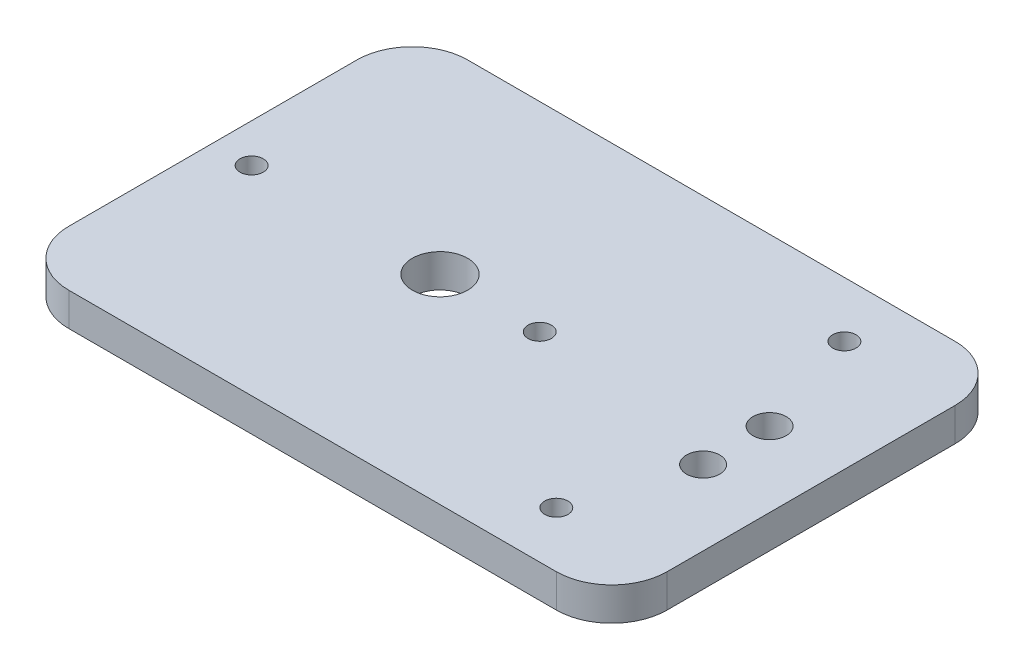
ISO-10303-21;
HEADER;
FILE_DESCRIPTION(('STEP AP214'),'2;1');
FILE_NAME('part.step','',(''),(''),'','','');
FILE_SCHEMA(('AUTOMOTIVE_DESIGN { 1 0 10303 214 1 1 1 1 }'));
ENDSEC;
DATA;
#1=APPLICATION_CONTEXT('core data for automotive mechanical design processes');
#2=APPLICATION_PROTOCOL_DEFINITION('international standard','automotive_design',2000,#1);
#3=PRODUCT_CONTEXT('',#1,'mechanical');
#4=PRODUCT('Part','Part','',(#3));
#5=PRODUCT_RELATED_PRODUCT_CATEGORY('part','',(#4));
#6=PRODUCT_DEFINITION_FORMATION('','',#4);
#7=PRODUCT_DEFINITION_CONTEXT('part definition',#1,'design');
#8=PRODUCT_DEFINITION('design','',#6,#7);
#9=PRODUCT_DEFINITION_SHAPE('','',#8);
#10=(LENGTH_UNIT() NAMED_UNIT(*) SI_UNIT(.MILLI.,.METRE.));
#11=(NAMED_UNIT(*) PLANE_ANGLE_UNIT() SI_UNIT($,.RADIAN.));
#12=(NAMED_UNIT(*) SI_UNIT($,.STERADIAN.) SOLID_ANGLE_UNIT());
#13=UNCERTAINTY_MEASURE_WITH_UNIT(LENGTH_MEASURE(1.E-05),#10,'distance_accuracy_value','');
#14=(GEOMETRIC_REPRESENTATION_CONTEXT(3) GLOBAL_UNCERTAINTY_ASSIGNED_CONTEXT((#13)) GLOBAL_UNIT_ASSIGNED_CONTEXT((#10,
#11,#12)) REPRESENTATION_CONTEXT('',''));
#15=CARTESIAN_POINT('',(0.,0.,0.));
#16=DIRECTION('',(0.,0.,1.));
#17=DIRECTION('',(1.,0.,0.));
#18=AXIS2_PLACEMENT_3D('',#15,#16,#17);
#19=CARTESIAN_POINT('',(10.,6.,-62.));
#20=DIRECTION('',(0.,1.,0.));
#21=DIRECTION('',(0.,0.,1.));
#22=AXIS2_PLACEMENT_3D('',#19,#20,#21);
#23=PLANE('',#22);
#24=CARTESIAN_POINT('',(7.,6.,-36.));
#25=DIRECTION('',(0.,1.,0.));
#26=DIRECTION('',(0.,0.,1.));
#27=AXIS2_PLACEMENT_3D('',#24,#25,#26);
#28=CIRCLE('',#27,2.09999999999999);
#29=CARTESIAN_POINT('',(7.,6.,-33.9));
#30=VERTEX_POINT('',#29);
#31=EDGE_CURVE('E215',#30,#30,#28,.T.);
#32=ORIENTED_EDGE('',*,*,#31,.F.);
#33=EDGE_LOOP('',(#32));
#34=FACE_BOUND('',#33,.T.);
#35=CARTESIAN_POINT('',(59.,6.,-36.));
#36=DIRECTION('',(0.,1.,0.));
#37=DIRECTION('',(0.,0.,1.));
#38=AXIS2_PLACEMENT_3D('',#35,#36,#37);
#39=CIRCLE('',#38,2.09999999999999);
#40=CARTESIAN_POINT('',(59.,6.,-33.9));
#41=VERTEX_POINT('',#40);
#42=EDGE_CURVE('E209',#41,#41,#39,.T.);
#43=ORIENTED_EDGE('',*,*,#42,.F.);
#44=EDGE_LOOP('',(#43));
#45=FACE_BOUND('',#44,.T.);
#46=CARTESIAN_POINT('',(88.,6.,-62.));
#47=DIRECTION('',(0.,1.,0.));
#48=DIRECTION('',(0.,0.,1.));
#49=AXIS2_PLACEMENT_3D('',#46,#47,#48);
#50=CIRCLE('',#49,2.09999999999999);
#51=CARTESIAN_POINT('',(88.,6.,-59.9));
#52=VERTEX_POINT('',#51);
#53=EDGE_CURVE('E203',#52,#52,#50,.T.);
#54=ORIENTED_EDGE('',*,*,#53,.F.);
#55=EDGE_LOOP('',(#54));
#56=FACE_BOUND('',#55,.T.);
#57=CARTESIAN_POINT('',(88.,6.,-10.));
#58=DIRECTION('',(0.,1.,0.));
#59=DIRECTION('',(0.,0.,1.));
#60=AXIS2_PLACEMENT_3D('',#57,#58,#59);
#61=CIRCLE('',#60,2.09999999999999);
#62=CARTESIAN_POINT('',(88.,6.,-7.90000000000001));
#63=VERTEX_POINT('',#62);
#64=EDGE_CURVE('E197',#63,#63,#61,.T.);
#65=ORIENTED_EDGE('',*,*,#64,.F.);
#66=EDGE_LOOP('',(#65));
#67=FACE_BOUND('',#66,.T.);
#68=CARTESIAN_POINT('',(94.4964786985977,6.,-42.));
#69=DIRECTION('',(0.,1.,0.));
#70=DIRECTION('',(0.,0.,1.));
#71=AXIS2_PLACEMENT_3D('',#68,#69,#70);
#72=CIRCLE('',#71,3.00000000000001);
#73=CARTESIAN_POINT('',(94.4964786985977,6.,-39.));
#74=VERTEX_POINT('',#73);
#75=EDGE_CURVE('E180',#74,#74,#72,.T.);
#76=ORIENTED_EDGE('',*,*,#75,.F.);
#77=EDGE_LOOP('',(#76));
#78=FACE_BOUND('',#77,.T.);
#79=CARTESIAN_POINT('',(10.,6.,-62.));
#80=DIRECTION('',(0.,1.,0.));
#81=DIRECTION('',(0.,0.,1.));
#82=AXIS2_PLACEMENT_3D('',#79,#80,#81);
#83=CIRCLE('',#82,10.);
#84=CARTESIAN_POINT('',(10.,6.,-72.));
#85=VERTEX_POINT('',#84);
#86=CARTESIAN_POINT('',(0.,6.,-62.));
#87=VERTEX_POINT('',#86);
#88=EDGE_CURVE('E143',#85,#87,#83,.T.);
#89=ORIENTED_EDGE('',*,*,#88,.T.);
#90=DIRECTION('',(0.,0.,1.));
#91=VECTOR('',#90,1.);
#92=CARTESIAN_POINT('',(0.,6.,-10.0000000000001));
#93=LINE('',#92,#91);
#94=CARTESIAN_POINT('',(0.,6.,-10.0000000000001));
#95=VERTEX_POINT('',#94);
#96=EDGE_CURVE('E91',#87,#95,#93,.T.);
#97=ORIENTED_EDGE('',*,*,#96,.T.);
#98=CARTESIAN_POINT('',(10.,6.,-10.));
#99=DIRECTION('',(0.,1.,0.));
#100=DIRECTION('',(0.,0.,1.));
#101=AXIS2_PLACEMENT_3D('',#98,#99,#100);
#102=CIRCLE('',#101,10.);
#103=CARTESIAN_POINT('',(10.0000000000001,6.,0.));
#104=VERTEX_POINT('',#103);
#105=EDGE_CURVE('E158',#95,#104,#102,.T.);
#106=ORIENTED_EDGE('',*,*,#105,.T.);
#107=DIRECTION('',(1.,0.,0.));
#108=VECTOR('',#107,1.);
#109=CARTESIAN_POINT('',(10.0000000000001,6.,0.));
#110=LINE('',#109,#108);
#111=CARTESIAN_POINT('',(97.9999999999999,6.,0.));
#112=VERTEX_POINT('',#111);
#113=EDGE_CURVE('E171',#104,#112,#110,.T.);
#114=ORIENTED_EDGE('',*,*,#113,.T.);
#115=CARTESIAN_POINT('',(98.,6.,-10.));
#116=DIRECTION('',(0.,1.,0.));
#117=DIRECTION('',(0.,0.,1.));
#118=AXIS2_PLACEMENT_3D('',#115,#116,#117);
#119=CIRCLE('',#118,10.);
#120=CARTESIAN_POINT('',(108.,6.,-10.0000000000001));
#121=VERTEX_POINT('',#120);
#122=EDGE_CURVE('E110',#112,#121,#119,.T.);
#123=ORIENTED_EDGE('',*,*,#122,.T.);
#124=DIRECTION('',(0.,0.,-1.));
#125=VECTOR('',#124,1.);
#126=CARTESIAN_POINT('',(108.,6.,-10.0000000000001));
#127=LINE('',#126,#125);
#128=CARTESIAN_POINT('',(108.,6.,-62.));
#129=VERTEX_POINT('',#128);
#130=EDGE_CURVE('E104',#121,#129,#127,.T.);
#131=ORIENTED_EDGE('',*,*,#130,.T.);
#132=CARTESIAN_POINT('',(98.,6.,-62.));
#133=DIRECTION('',(0.,1.,0.));
#134=DIRECTION('',(0.,0.,1.));
#135=AXIS2_PLACEMENT_3D('',#132,#133,#134);
#136=CIRCLE('',#135,10.);
#137=CARTESIAN_POINT('',(98.,6.,-72.));
#138=VERTEX_POINT('',#137);
#139=EDGE_CURVE('E108',#129,#138,#136,.T.);
#140=ORIENTED_EDGE('',*,*,#139,.T.);
#141=DIRECTION('',(-1.,0.,0.));
#142=VECTOR('',#141,1.);
#143=CARTESIAN_POINT('',(10.,6.,-72.));
#144=LINE('',#143,#142);
#145=EDGE_CURVE('E48',#138,#85,#144,.T.);
#146=ORIENTED_EDGE('',*,*,#145,.T.);
#147=EDGE_LOOP('',(#89,#97,#106,#114,#123,#131,#140,#146));
#148=FACE_BOUND('',#147,.T.);
#149=CARTESIAN_POINT('',(41.,6.,-36.));
#150=DIRECTION('',(0.,1.,0.));
#151=DIRECTION('',(0.,0.,1.));
#152=AXIS2_PLACEMENT_3D('',#149,#150,#151);
#153=CIRCLE('',#152,5.);
#154=CARTESIAN_POINT('',(41.,6.,-31.));
#155=VERTEX_POINT('',#154);
#156=EDGE_CURVE('E132',#155,#155,#153,.T.);
#157=ORIENTED_EDGE('',*,*,#156,.F.);
#158=EDGE_LOOP('',(#157));
#159=FACE_BOUND('',#158,.T.);
#160=CARTESIAN_POINT('',(94.4964786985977,6.,-30.));
#161=DIRECTION('',(0.,1.,0.));
#162=DIRECTION('',(0.,0.,1.));
#163=AXIS2_PLACEMENT_3D('',#160,#161,#162);
#164=CIRCLE('',#163,3.00000000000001);
#165=CARTESIAN_POINT('',(94.4964786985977,6.,-27.));
#166=VERTEX_POINT('',#165);
#167=EDGE_CURVE('E186',#166,#166,#164,.T.);
#168=ORIENTED_EDGE('',*,*,#167,.F.);
#169=EDGE_LOOP('',(#168));
#170=FACE_BOUND('',#169,.T.);
#171=ADVANCED_FACE('F31',(#34,#45,#56,#67,#78,#148,#159,#170),#23,.T.);
#172=CARTESIAN_POINT('',(10.,0.,-62.));
#173=DIRECTION('',(0.,1.,0.));
#174=DIRECTION('',(0.,0.,1.));
#175=AXIS2_PLACEMENT_3D('',#172,#173,#174);
#176=PLANE('',#175);
#177=CARTESIAN_POINT('',(7.,0.,-36.));
#178=DIRECTION('',(0.,1.,0.));
#179=DIRECTION('',(0.,0.,1.));
#180=AXIS2_PLACEMENT_3D('',#177,#178,#179);
#181=CIRCLE('',#180,2.1);
#182=CARTESIAN_POINT('',(7.,0.,-33.9));
#183=VERTEX_POINT('',#182);
#184=EDGE_CURVE('E212',#183,#183,#181,.T.);
#185=ORIENTED_EDGE('',*,*,#184,.T.);
#186=EDGE_LOOP('',(#185));
#187=FACE_BOUND('',#186,.T.);
#188=CARTESIAN_POINT('',(59.,0.,-36.));
#189=DIRECTION('',(0.,1.,0.));
#190=DIRECTION('',(0.,0.,1.));
#191=AXIS2_PLACEMENT_3D('',#188,#189,#190);
#192=CIRCLE('',#191,2.1);
#193=CARTESIAN_POINT('',(59.,0.,-33.9));
#194=VERTEX_POINT('',#193);
#195=EDGE_CURVE('E206',#194,#194,#192,.T.);
#196=ORIENTED_EDGE('',*,*,#195,.T.);
#197=EDGE_LOOP('',(#196));
#198=FACE_BOUND('',#197,.T.);
#199=CARTESIAN_POINT('',(88.,0.,-62.));
#200=DIRECTION('',(0.,1.,0.));
#201=DIRECTION('',(0.,0.,1.));
#202=AXIS2_PLACEMENT_3D('',#199,#200,#201);
#203=CIRCLE('',#202,2.1);
#204=CARTESIAN_POINT('',(88.,0.,-59.9));
#205=VERTEX_POINT('',#204);
#206=EDGE_CURVE('E200',#205,#205,#203,.T.);
#207=ORIENTED_EDGE('',*,*,#206,.T.);
#208=EDGE_LOOP('',(#207));
#209=FACE_BOUND('',#208,.T.);
#210=CARTESIAN_POINT('',(88.,0.,-10.));
#211=DIRECTION('',(0.,1.,0.));
#212=DIRECTION('',(0.,0.,1.));
#213=AXIS2_PLACEMENT_3D('',#210,#211,#212);
#214=CIRCLE('',#213,2.09999999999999);
#215=CARTESIAN_POINT('',(88.,0.,-7.90000000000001));
#216=VERTEX_POINT('',#215);
#217=EDGE_CURVE('E192',#216,#216,#214,.T.);
#218=ORIENTED_EDGE('',*,*,#217,.T.);
#219=EDGE_LOOP('',(#218));
#220=FACE_BOUND('',#219,.T.);
#221=CARTESIAN_POINT('',(94.4964786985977,0.,-42.));
#222=DIRECTION('',(0.,1.,0.));
#223=DIRECTION('',(0.,0.,1.));
#224=AXIS2_PLACEMENT_3D('',#221,#222,#223);
#225=CIRCLE('',#224,3.00000000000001);
#226=CARTESIAN_POINT('',(94.4964786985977,0.,-39.));
#227=VERTEX_POINT('',#226);
#228=EDGE_CURVE('E183',#227,#227,#225,.T.);
#229=ORIENTED_EDGE('',*,*,#228,.T.);
#230=EDGE_LOOP('',(#229));
#231=FACE_BOUND('',#230,.T.);
#232=CARTESIAN_POINT('',(10.,0.,-62.));
#233=DIRECTION('',(0.,1.,0.));
#234=DIRECTION('',(0.,0.,1.));
#235=AXIS2_PLACEMENT_3D('',#232,#233,#234);
#236=CIRCLE('',#235,10.);
#237=CARTESIAN_POINT('',(10.,0.,-72.));
#238=VERTEX_POINT('',#237);
#239=CARTESIAN_POINT('',(0.,0.,-62.));
#240=VERTEX_POINT('',#239);
#241=EDGE_CURVE('E128',#238,#240,#236,.T.);
#242=ORIENTED_EDGE('',*,*,#241,.F.);
#243=DIRECTION('',(-1.,0.,0.));
#244=VECTOR('',#243,1.);
#245=CARTESIAN_POINT('',(10.,0.,-72.));
#246=LINE('',#245,#244);
#247=CARTESIAN_POINT('',(98.,0.,-72.));
#248=VERTEX_POINT('',#247);
#249=EDGE_CURVE('E83',#248,#238,#246,.T.);
#250=ORIENTED_EDGE('',*,*,#249,.F.);
#251=CARTESIAN_POINT('',(98.,0.,-62.));
#252=DIRECTION('',(0.,1.,0.));
#253=DIRECTION('',(0.,0.,1.));
#254=AXIS2_PLACEMENT_3D('',#251,#252,#253);
#255=CIRCLE('',#254,10.);
#256=CARTESIAN_POINT('',(108.,0.,-62.));
#257=VERTEX_POINT('',#256);
#258=EDGE_CURVE('E77',#257,#248,#255,.T.);
#259=ORIENTED_EDGE('',*,*,#258,.F.);
#260=DIRECTION('',(0.,0.,-1.));
#261=VECTOR('',#260,1.);
#262=CARTESIAN_POINT('',(108.,0.,-10.0000000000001));
#263=LINE('',#262,#261);
#264=CARTESIAN_POINT('',(108.,0.,-10.0000000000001));
#265=VERTEX_POINT('',#264);
#266=EDGE_CURVE('E118',#265,#257,#263,.T.);
#267=ORIENTED_EDGE('',*,*,#266,.F.);
#268=CARTESIAN_POINT('',(98.,0.,-10.));
#269=DIRECTION('',(0.,1.,0.));
#270=DIRECTION('',(0.,0.,1.));
#271=AXIS2_PLACEMENT_3D('',#268,#269,#270);
#272=CIRCLE('',#271,10.);
#273=CARTESIAN_POINT('',(97.9999999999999,0.,0.));
#274=VERTEX_POINT('',#273);
#275=EDGE_CURVE('E138',#274,#265,#272,.T.);
#276=ORIENTED_EDGE('',*,*,#275,.F.);
#277=DIRECTION('',(1.,0.,0.));
#278=VECTOR('',#277,1.);
#279=CARTESIAN_POINT('',(10.0000000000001,0.,0.));
#280=LINE('',#279,#278);
#281=CARTESIAN_POINT('',(10.0000000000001,0.,0.));
#282=VERTEX_POINT('',#281);
#283=EDGE_CURVE('E136',#282,#274,#280,.T.);
#284=ORIENTED_EDGE('',*,*,#283,.F.);
#285=CARTESIAN_POINT('',(10.,0.,-10.));
#286=DIRECTION('',(0.,1.,0.));
#287=DIRECTION('',(0.,0.,1.));
#288=AXIS2_PLACEMENT_3D('',#285,#286,#287);
#289=CIRCLE('',#288,10.);
#290=CARTESIAN_POINT('',(0.,0.,-10.0000000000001));
#291=VERTEX_POINT('',#290);
#292=EDGE_CURVE('E134',#291,#282,#289,.T.);
#293=ORIENTED_EDGE('',*,*,#292,.F.);
#294=DIRECTION('',(0.,0.,1.));
#295=VECTOR('',#294,1.);
#296=CARTESIAN_POINT('',(0.,0.,-10.0000000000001));
#297=LINE('',#296,#295);
#298=EDGE_CURVE('E131',#240,#291,#297,.T.);
#299=ORIENTED_EDGE('',*,*,#298,.F.);
#300=EDGE_LOOP('',(#242,#250,#259,#267,#276,#284,#293,#299));
#301=FACE_BOUND('',#300,.T.);
#302=CARTESIAN_POINT('',(41.,0.,-36.));
#303=DIRECTION('',(0.,1.,0.));
#304=DIRECTION('',(0.,0.,1.));
#305=AXIS2_PLACEMENT_3D('',#302,#303,#304);
#306=CIRCLE('',#305,5.);
#307=CARTESIAN_POINT('',(41.,0.,-31.));
#308=VERTEX_POINT('',#307);
#309=EDGE_CURVE('E177',#308,#308,#306,.T.);
#310=ORIENTED_EDGE('',*,*,#309,.T.);
#311=EDGE_LOOP('',(#310));
#312=FACE_BOUND('',#311,.T.);
#313=CARTESIAN_POINT('',(94.4964786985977,0.,-30.));
#314=DIRECTION('',(0.,1.,0.));
#315=DIRECTION('',(0.,0.,1.));
#316=AXIS2_PLACEMENT_3D('',#313,#314,#315);
#317=CIRCLE('',#316,3.00000000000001);
#318=CARTESIAN_POINT('',(94.4964786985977,0.,-27.));
#319=VERTEX_POINT('',#318);
#320=EDGE_CURVE('E189',#319,#319,#317,.T.);
#321=ORIENTED_EDGE('',*,*,#320,.T.);
#322=EDGE_LOOP('',(#321));
#323=FACE_BOUND('',#322,.T.);
#324=ADVANCED_FACE('F162',(#187,#198,#209,#220,#231,#301,#312,#323),#176,.F.);
#325=CARTESIAN_POINT('',(10.,6.,-62.));
#326=DIRECTION('',(0.,-1.,0.));
#327=DIRECTION('',(0.,0.,-1.));
#328=AXIS2_PLACEMENT_3D('',#325,#326,#327);
#329=CYLINDRICAL_SURFACE('',#328,10.);
#330=ORIENTED_EDGE('',*,*,#241,.T.);
#331=DIRECTION('',(0.,-1.,0.));
#332=VECTOR('',#331,1.);
#333=CARTESIAN_POINT('',(0.,6.,-62.));
#334=LINE('',#333,#332);
#335=EDGE_CURVE('E11',#87,#240,#334,.T.);
#336=ORIENTED_EDGE('',*,*,#335,.F.);
#337=ORIENTED_EDGE('',*,*,#88,.F.);
#338=DIRECTION('',(0.,-1.,0.));
#339=VECTOR('',#338,1.);
#340=CARTESIAN_POINT('',(10.,6.,-72.));
#341=LINE('',#340,#339);
#342=EDGE_CURVE('E124',#85,#238,#341,.T.);
#343=ORIENTED_EDGE('',*,*,#342,.T.);
#344=EDGE_LOOP('',(#330,#336,#337,#343));
#345=FACE_BOUND('',#344,.T.);
#346=ADVANCED_FACE('F33',(#345),#329,.T.);
#347=CARTESIAN_POINT('',(0.,6.,-10.0000000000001));
#348=DIRECTION('',(1.,0.,0.));
#349=DIRECTION('',(0.,0.,-1.));
#350=AXIS2_PLACEMENT_3D('',#347,#348,#349);
#351=PLANE('',#350);
#352=ORIENTED_EDGE('',*,*,#298,.T.);
#353=DIRECTION('',(0.,-1.,0.));
#354=VECTOR('',#353,1.);
#355=CARTESIAN_POINT('',(0.,6.,-10.0000000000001));
#356=LINE('',#355,#354);
#357=EDGE_CURVE('E40',#95,#291,#356,.T.);
#358=ORIENTED_EDGE('',*,*,#357,.F.);
#359=ORIENTED_EDGE('',*,*,#96,.F.);
#360=ORIENTED_EDGE('',*,*,#335,.T.);
#361=EDGE_LOOP('',(#352,#358,#359,#360));
#362=FACE_BOUND('',#361,.T.);
#363=ADVANCED_FACE('F246',(#362),#351,.F.);
#364=CARTESIAN_POINT('',(10.,6.,-10.));
#365=DIRECTION('',(0.,-1.,0.));
#366=DIRECTION('',(0.,0.,-1.));
#367=AXIS2_PLACEMENT_3D('',#364,#365,#366);
#368=CYLINDRICAL_SURFACE('',#367,10.);
#369=ORIENTED_EDGE('',*,*,#292,.T.);
#370=DIRECTION('',(0.,-1.,0.));
#371=VECTOR('',#370,1.);
#372=CARTESIAN_POINT('',(10.0000000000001,6.,0.));
#373=LINE('',#372,#371);
#374=EDGE_CURVE('E150',#104,#282,#373,.T.);
#375=ORIENTED_EDGE('',*,*,#374,.F.);
#376=ORIENTED_EDGE('',*,*,#105,.F.);
#377=ORIENTED_EDGE('',*,*,#357,.T.);
#378=EDGE_LOOP('',(#369,#375,#376,#377));
#379=FACE_BOUND('',#378,.T.);
#380=ADVANCED_FACE('F156',(#379),#368,.T.);
#381=CARTESIAN_POINT('',(10.0000000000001,6.,0.));
#382=DIRECTION('',(0.,0.,-1.));
#383=DIRECTION('',(-1.,0.,0.));
#384=AXIS2_PLACEMENT_3D('',#381,#382,#383);
#385=PLANE('',#384);
#386=ORIENTED_EDGE('',*,*,#283,.T.);
#387=DIRECTION('',(0.,-1.,0.));
#388=VECTOR('',#387,1.);
#389=CARTESIAN_POINT('',(97.9999999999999,6.,0.));
#390=LINE('',#389,#388);
#391=EDGE_CURVE('E147',#112,#274,#390,.T.);
#392=ORIENTED_EDGE('',*,*,#391,.F.);
#393=ORIENTED_EDGE('',*,*,#113,.F.);
#394=ORIENTED_EDGE('',*,*,#374,.T.);
#395=EDGE_LOOP('',(#386,#392,#393,#394));
#396=FACE_BOUND('',#395,.T.);
#397=ADVANCED_FACE('F167',(#396),#385,.F.);
#398=CARTESIAN_POINT('',(98.,6.,-10.));
#399=DIRECTION('',(0.,-1.,0.));
#400=DIRECTION('',(0.,0.,-1.));
#401=AXIS2_PLACEMENT_3D('',#398,#399,#400);
#402=CYLINDRICAL_SURFACE('',#401,10.);
#403=ORIENTED_EDGE('',*,*,#275,.T.);
#404=DIRECTION('',(0.,-1.,0.));
#405=VECTOR('',#404,1.);
#406=CARTESIAN_POINT('',(108.,6.,-10.0000000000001));
#407=LINE('',#406,#405);
#408=EDGE_CURVE('E119',#121,#265,#407,.T.);
#409=ORIENTED_EDGE('',*,*,#408,.F.);
#410=ORIENTED_EDGE('',*,*,#122,.F.);
#411=ORIENTED_EDGE('',*,*,#391,.T.);
#412=EDGE_LOOP('',(#403,#409,#410,#411));
#413=FACE_BOUND('',#412,.T.);
#414=ADVANCED_FACE('F170',(#413),#402,.T.);
#415=CARTESIAN_POINT('',(108.,6.,-10.0000000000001));
#416=DIRECTION('',(-1.,0.,0.));
#417=DIRECTION('',(0.,0.,1.));
#418=AXIS2_PLACEMENT_3D('',#415,#416,#417);
#419=PLANE('',#418);
#420=ORIENTED_EDGE('',*,*,#266,.T.);
#421=DIRECTION('',(0.,-1.,0.));
#422=VECTOR('',#421,1.);
#423=CARTESIAN_POINT('',(108.,6.,-62.));
#424=LINE('',#423,#422);
#425=EDGE_CURVE('E115',#129,#257,#424,.T.);
#426=ORIENTED_EDGE('',*,*,#425,.F.);
#427=ORIENTED_EDGE('',*,*,#130,.F.);
#428=ORIENTED_EDGE('',*,*,#408,.T.);
#429=EDGE_LOOP('',(#420,#426,#427,#428));
#430=FACE_BOUND('',#429,.T.);
#431=ADVANCED_FACE('F116',(#430),#419,.F.);
#432=CARTESIAN_POINT('',(98.,6.,-62.));
#433=DIRECTION('',(0.,-1.,0.));
#434=DIRECTION('',(0.,0.,-1.));
#435=AXIS2_PLACEMENT_3D('',#432,#433,#434);
#436=CYLINDRICAL_SURFACE('',#435,10.);
#437=ORIENTED_EDGE('',*,*,#258,.T.);
#438=DIRECTION('',(0.,-1.,0.));
#439=VECTOR('',#438,1.);
#440=CARTESIAN_POINT('',(98.,6.,-72.));
#441=LINE('',#440,#439);
#442=EDGE_CURVE('E120',#138,#248,#441,.T.);
#443=ORIENTED_EDGE('',*,*,#442,.F.);
#444=ORIENTED_EDGE('',*,*,#139,.F.);
#445=ORIENTED_EDGE('',*,*,#425,.T.);
#446=EDGE_LOOP('',(#437,#443,#444,#445));
#447=FACE_BOUND('',#446,.T.);
#448=ADVANCED_FACE('F122',(#447),#436,.T.);
#449=CARTESIAN_POINT('',(10.,6.,-72.));
#450=DIRECTION('',(0.,0.,1.));
#451=DIRECTION('',(1.,0.,0.));
#452=AXIS2_PLACEMENT_3D('',#449,#450,#451);
#453=PLANE('',#452);
#454=ORIENTED_EDGE('',*,*,#249,.T.);
#455=ORIENTED_EDGE('',*,*,#342,.F.);
#456=ORIENTED_EDGE('',*,*,#145,.F.);
#457=ORIENTED_EDGE('',*,*,#442,.T.);
#458=EDGE_LOOP('',(#454,#455,#456,#457));
#459=FACE_BOUND('',#458,.T.);
#460=ADVANCED_FACE('F251',(#459),#453,.F.);
#461=CARTESIAN_POINT('',(41.,6.,-36.));
#462=DIRECTION('',(0.,-1.,0.));
#463=DIRECTION('',(0.,0.,-1.));
#464=AXIS2_PLACEMENT_3D('',#461,#462,#463);
#465=CYLINDRICAL_SURFACE('',#464,5.);
#466=ORIENTED_EDGE('',*,*,#156,.T.);
#467=EDGE_LOOP('',(#466));
#468=FACE_BOUND('',#467,.T.);
#469=ORIENTED_EDGE('',*,*,#309,.F.);
#470=EDGE_LOOP('',(#469));
#471=FACE_BOUND('',#470,.T.);
#472=ADVANCED_FACE('F236',(#468,#471),#465,.F.);
#473=CARTESIAN_POINT('',(94.4964786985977,6.,-42.));
#474=DIRECTION('',(0.,-1.,0.));
#475=DIRECTION('',(0.,0.,-1.));
#476=AXIS2_PLACEMENT_3D('',#473,#474,#475);
#477=CYLINDRICAL_SURFACE('',#476,3.00000000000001);
#478=ORIENTED_EDGE('',*,*,#75,.T.);
#479=EDGE_LOOP('',(#478));
#480=FACE_BOUND('',#479,.T.);
#481=ORIENTED_EDGE('',*,*,#228,.F.);
#482=EDGE_LOOP('',(#481));
#483=FACE_BOUND('',#482,.T.);
#484=ADVANCED_FACE('F232',(#480,#483),#477,.F.);
#485=CARTESIAN_POINT('',(94.4964786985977,6.,-30.));
#486=DIRECTION('',(0.,-1.,0.));
#487=DIRECTION('',(0.,0.,-1.));
#488=AXIS2_PLACEMENT_3D('',#485,#486,#487);
#489=CYLINDRICAL_SURFACE('',#488,3.00000000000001);
#490=ORIENTED_EDGE('',*,*,#167,.T.);
#491=EDGE_LOOP('',(#490));
#492=FACE_BOUND('',#491,.T.);
#493=ORIENTED_EDGE('',*,*,#320,.F.);
#494=EDGE_LOOP('',(#493));
#495=FACE_BOUND('',#494,.T.);
#496=ADVANCED_FACE('F235',(#492,#495),#489,.F.);
#497=CARTESIAN_POINT('',(88.,6.,-10.));
#498=DIRECTION('',(0.,1.,0.));
#499=DIRECTION('',(0.,0.,1.));
#500=AXIS2_PLACEMENT_3D('',#497,#498,#499);
#501=CYLINDRICAL_SURFACE('',#500,2.09999999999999);
#502=ORIENTED_EDGE('',*,*,#217,.F.);
#503=EDGE_LOOP('',(#502));
#504=FACE_BOUND('',#503,.T.);
#505=ORIENTED_EDGE('',*,*,#64,.T.);
#506=EDGE_LOOP('',(#505));
#507=FACE_BOUND('',#506,.T.);
#508=ADVANCED_FACE('F310',(#504,#507),#501,.F.);
#509=CARTESIAN_POINT('',(88.,6.,-62.));
#510=DIRECTION('',(0.,1.,0.));
#511=DIRECTION('',(0.,0.,1.));
#512=AXIS2_PLACEMENT_3D('',#509,#510,#511);
#513=CYLINDRICAL_SURFACE('',#512,2.1);
#514=ORIENTED_EDGE('',*,*,#206,.F.);
#515=EDGE_LOOP('',(#514));
#516=FACE_BOUND('',#515,.T.);
#517=ORIENTED_EDGE('',*,*,#53,.T.);
#518=EDGE_LOOP('',(#517));
#519=FACE_BOUND('',#518,.T.);
#520=ADVANCED_FACE('F319',(#516,#519),#513,.F.);
#521=CARTESIAN_POINT('',(59.,6.,-36.));
#522=DIRECTION('',(0.,1.,0.));
#523=DIRECTION('',(0.,0.,1.));
#524=AXIS2_PLACEMENT_3D('',#521,#522,#523);
#525=CYLINDRICAL_SURFACE('',#524,2.09999999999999);
#526=ORIENTED_EDGE('',*,*,#195,.F.);
#527=EDGE_LOOP('',(#526));
#528=FACE_BOUND('',#527,.T.);
#529=ORIENTED_EDGE('',*,*,#42,.T.);
#530=EDGE_LOOP('',(#529));
#531=FACE_BOUND('',#530,.T.);
#532=ADVANCED_FACE('F327',(#528,#531),#525,.F.);
#533=CARTESIAN_POINT('',(7.,6.,-36.));
#534=DIRECTION('',(0.,1.,0.));
#535=DIRECTION('',(0.,0.,1.));
#536=AXIS2_PLACEMENT_3D('',#533,#534,#535);
#537=CYLINDRICAL_SURFACE('',#536,2.09999999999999);
#538=ORIENTED_EDGE('',*,*,#184,.F.);
#539=EDGE_LOOP('',(#538));
#540=FACE_BOUND('',#539,.T.);
#541=ORIENTED_EDGE('',*,*,#31,.T.);
#542=EDGE_LOOP('',(#541));
#543=FACE_BOUND('',#542,.T.);
#544=ADVANCED_FACE('F219',(#540,#543),#537,.F.);
#545=CLOSED_SHELL('',(#171,#324,#346,#363,#380,#397,#414,#431,#448,#460,#472,#484,#496,#508,
#520,#532,#544));
#546=MANIFOLD_SOLID_BREP('B2',#545);
#547=ADVANCED_BREP_SHAPE_REPRESENTATION('',(#18,#546),#14);
#548=SHAPE_DEFINITION_REPRESENTATION(#9,#547);
ENDSEC;
END-ISO-10303-21;
